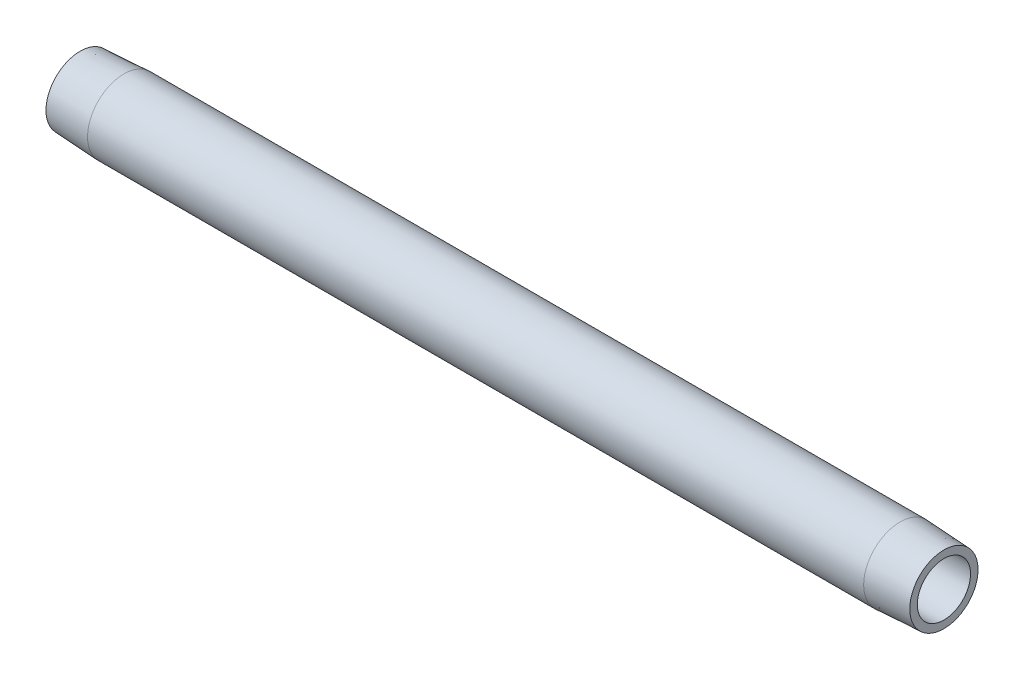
ISO-10303-21;
HEADER;
FILE_DESCRIPTION(('STEP AP214'),'2;1');
FILE_NAME('part.step','',(''),(''),'','','');
FILE_SCHEMA(('AUTOMOTIVE_DESIGN { 1 0 10303 214 1 1 1 1 }'));
ENDSEC;
DATA;
#1=APPLICATION_CONTEXT('core data for automotive mechanical design processes');
#2=APPLICATION_PROTOCOL_DEFINITION('international standard','automotive_design',2000,#1);
#3=PRODUCT_CONTEXT('',#1,'mechanical');
#4=PRODUCT('Part','Part','',(#3));
#5=PRODUCT_RELATED_PRODUCT_CATEGORY('part','',(#4));
#6=PRODUCT_DEFINITION_FORMATION('','',#4);
#7=PRODUCT_DEFINITION_CONTEXT('part definition',#1,'design');
#8=PRODUCT_DEFINITION('design','',#6,#7);
#9=PRODUCT_DEFINITION_SHAPE('','',#8);
#10=(LENGTH_UNIT() NAMED_UNIT(*) SI_UNIT(.MILLI.,.METRE.));
#11=(NAMED_UNIT(*) PLANE_ANGLE_UNIT() SI_UNIT($,.RADIAN.));
#12=(NAMED_UNIT(*) SI_UNIT($,.STERADIAN.) SOLID_ANGLE_UNIT());
#13=UNCERTAINTY_MEASURE_WITH_UNIT(LENGTH_MEASURE(1.E-05),#10,'distance_accuracy_value','');
#14=(GEOMETRIC_REPRESENTATION_CONTEXT(3) GLOBAL_UNCERTAINTY_ASSIGNED_CONTEXT((#13)) GLOBAL_UNIT_ASSIGNED_CONTEXT((#10,
#11,#12)) REPRESENTATION_CONTEXT('',''));
#15=CARTESIAN_POINT('',(0.,0.,0.));
#16=DIRECTION('',(0.,0.,1.));
#17=DIRECTION('',(1.,0.,0.));
#18=AXIS2_PLACEMENT_3D('',#15,#16,#17);
#19=CARTESIAN_POINT('',(203.2,6.26110000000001,0.));
#20=DIRECTION('',(-1.,0.,0.));
#21=DIRECTION('',(0.,0.,1.));
#22=AXIS2_PLACEMENT_3D('',#19,#20,#21);
#23=PLANE('',#22);
#24=CARTESIAN_POINT('',(203.2,0.,0.));
#25=DIRECTION('',(-1.,0.,0.));
#26=DIRECTION('',(0.,0.,1.));
#27=AXIS2_PLACEMENT_3D('',#24,#25,#26);
#28=CIRCLE('',#27,8.03205001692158);
#29=CARTESIAN_POINT('',(203.2,0.,8.03205001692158));
#30=VERTEX_POINT('',#29);
#31=EDGE_CURVE('E10',#30,#30,#28,.T.);
#32=ORIENTED_EDGE('',*,*,#31,.F.);
#33=EDGE_LOOP('',(#32));
#34=FACE_BOUND('',#33,.T.);
#35=CARTESIAN_POINT('',(203.2,0.,0.));
#36=DIRECTION('',(-1.,0.,0.));
#37=DIRECTION('',(0.,0.,1.));
#38=AXIS2_PLACEMENT_3D('',#35,#36,#37);
#39=CIRCLE('',#38,6.26110000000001);
#40=CARTESIAN_POINT('',(203.2,0.,6.26110000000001));
#41=VERTEX_POINT('',#40);
#42=EDGE_CURVE('E52',#41,#41,#39,.T.);
#43=ORIENTED_EDGE('',*,*,#42,.T.);
#44=EDGE_LOOP('',(#43));
#45=FACE_BOUND('',#44,.T.);
#46=ADVANCED_FACE('F30',(#34,#45),#23,.F.);
#47=CARTESIAN_POINT('',(203.2,0.,0.));
#48=DIRECTION('',(-1.,0.,0.));
#49=DIRECTION('',(0.,0.,1.));
#50=AXIS2_PLACEMENT_3D('',#47,#48,#49);
#51=CONICAL_SURFACE('',#50,8.03205001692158,0.0523598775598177);
#52=CARTESIAN_POINT('',(192.8876,0.,0.));
#53=DIRECTION('',(-1.,0.,0.));
#54=DIRECTION('',(0.,0.,1.));
#55=AXIS2_PLACEMENT_3D('',#52,#53,#54);
#56=CIRCLE('',#55,8.57249999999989);
#57=CARTESIAN_POINT('',(192.8876,0.,8.57249999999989));
#58=VERTEX_POINT('',#57);
#59=EDGE_CURVE('E36',#58,#58,#56,.T.);
#60=ORIENTED_EDGE('',*,*,#59,.F.);
#61=EDGE_LOOP('',(#60));
#62=FACE_BOUND('',#61,.T.);
#63=ORIENTED_EDGE('',*,*,#31,.T.);
#64=EDGE_LOOP('',(#63));
#65=FACE_BOUND('',#64,.T.);
#66=ADVANCED_FACE('F77',(#62,#65),#51,.T.);
#67=CARTESIAN_POINT('',(0.,0.,0.));
#68=DIRECTION('',(-1.,0.,0.));
#69=DIRECTION('',(0.,0.,1.));
#70=AXIS2_PLACEMENT_3D('',#67,#68,#69);
#71=CYLINDRICAL_SURFACE('',#70,8.57249999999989);
#72=CARTESIAN_POINT('',(10.3124,0.,0.));
#73=DIRECTION('',(-1.,0.,0.));
#74=DIRECTION('',(0.,0.,1.));
#75=AXIS2_PLACEMENT_3D('',#72,#73,#74);
#76=CIRCLE('',#75,8.57249999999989);
#77=CARTESIAN_POINT('',(10.3124,0.,8.57249999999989));
#78=VERTEX_POINT('',#77);
#79=EDGE_CURVE('E40',#78,#78,#76,.T.);
#80=ORIENTED_EDGE('',*,*,#79,.F.);
#81=EDGE_LOOP('',(#80));
#82=FACE_BOUND('',#81,.T.);
#83=ORIENTED_EDGE('',*,*,#59,.T.);
#84=EDGE_LOOP('',(#83));
#85=FACE_BOUND('',#84,.T.);
#86=ADVANCED_FACE('F72',(#82,#85),#71,.T.);
#87=CARTESIAN_POINT('',(10.3124,0.,0.));
#88=DIRECTION('',(1.,0.,0.));
#89=DIRECTION('',(0.,0.,-1.));
#90=AXIS2_PLACEMENT_3D('',#87,#88,#89);
#91=CONICAL_SURFACE('',#90,8.57249999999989,0.0523598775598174);
#92=CARTESIAN_POINT('',(0.,0.,0.));
#93=DIRECTION('',(-1.,0.,0.));
#94=DIRECTION('',(0.,0.,1.));
#95=AXIS2_PLACEMENT_3D('',#92,#93,#94);
#96=CIRCLE('',#95,8.03205001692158);
#97=CARTESIAN_POINT('',(0.,0.,8.03205001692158));
#98=VERTEX_POINT('',#97);
#99=EDGE_CURVE('E44',#98,#98,#96,.T.);
#100=ORIENTED_EDGE('',*,*,#99,.F.);
#101=EDGE_LOOP('',(#100));
#102=FACE_BOUND('',#101,.T.);
#103=ORIENTED_EDGE('',*,*,#79,.T.);
#104=EDGE_LOOP('',(#103));
#105=FACE_BOUND('',#104,.T.);
#106=ADVANCED_FACE('F66',(#102,#105),#91,.T.);
#107=CARTESIAN_POINT('',(0.,6.26110000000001,0.));
#108=DIRECTION('',(1.,0.,0.));
#109=DIRECTION('',(0.,0.,-1.));
#110=AXIS2_PLACEMENT_3D('',#107,#108,#109);
#111=PLANE('',#110);
#112=CARTESIAN_POINT('',(0.,0.,0.));
#113=DIRECTION('',(-1.,0.,0.));
#114=DIRECTION('',(0.,0.,1.));
#115=AXIS2_PLACEMENT_3D('',#112,#113,#114);
#116=CIRCLE('',#115,6.26110000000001);
#117=CARTESIAN_POINT('',(0.,0.,6.26110000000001));
#118=VERTEX_POINT('',#117);
#119=EDGE_CURVE('E49',#118,#118,#116,.T.);
#120=ORIENTED_EDGE('',*,*,#119,.F.);
#121=EDGE_LOOP('',(#120));
#122=FACE_BOUND('',#121,.T.);
#123=ORIENTED_EDGE('',*,*,#99,.T.);
#124=EDGE_LOOP('',(#123));
#125=FACE_BOUND('',#124,.T.);
#126=ADVANCED_FACE('F60',(#122,#125),#111,.F.);
#127=CARTESIAN_POINT('',(0.,0.,0.));
#128=DIRECTION('',(-1.,0.,0.));
#129=DIRECTION('',(0.,0.,1.));
#130=AXIS2_PLACEMENT_3D('',#127,#128,#129);
#131=CYLINDRICAL_SURFACE('',#130,6.26110000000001);
#132=ORIENTED_EDGE('',*,*,#42,.F.);
#133=EDGE_LOOP('',(#132));
#134=FACE_BOUND('',#133,.T.);
#135=ORIENTED_EDGE('',*,*,#119,.T.);
#136=EDGE_LOOP('',(#135));
#137=FACE_BOUND('',#136,.T.);
#138=ADVANCED_FACE('F57',(#134,#137),#131,.F.);
#139=CLOSED_SHELL('',(#46,#66,#86,#106,#126,#138));
#140=MANIFOLD_SOLID_BREP('B2',#139);
#141=ADVANCED_BREP_SHAPE_REPRESENTATION('',(#18,#140),#14);
#142=SHAPE_DEFINITION_REPRESENTATION(#9,#141);
ENDSEC;
END-ISO-10303-21;
